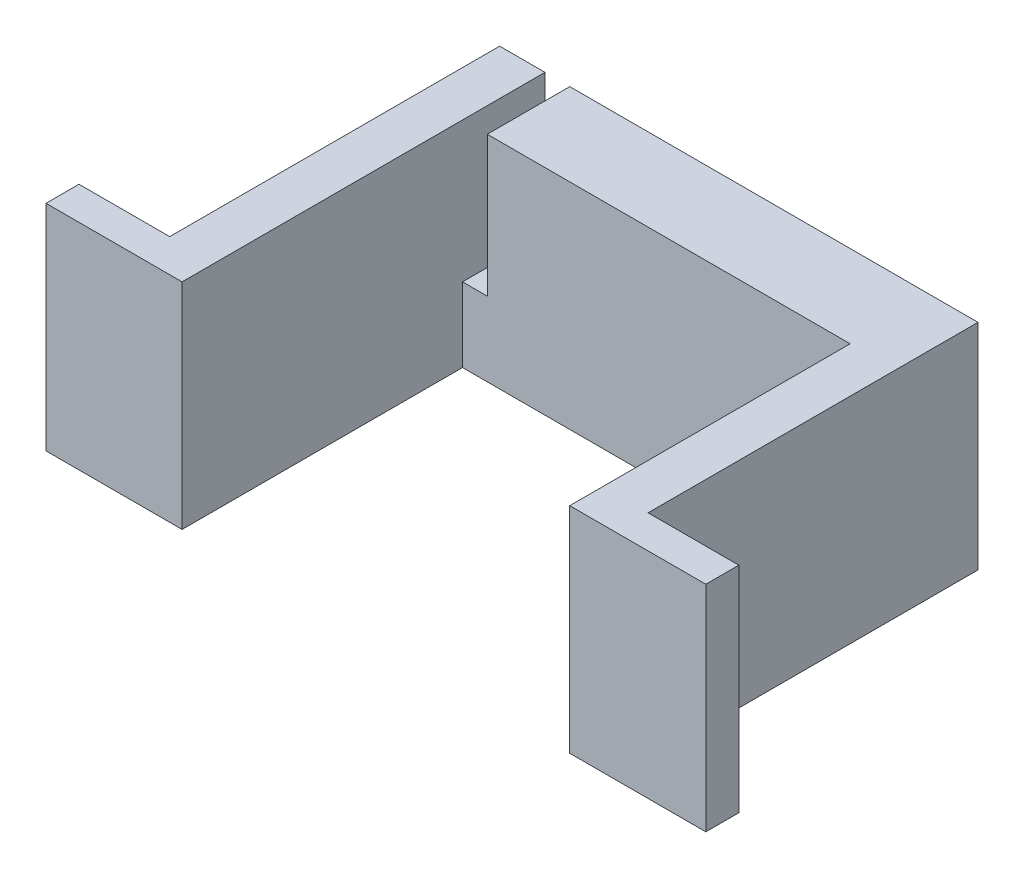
ISO-10303-21;
HEADER;
FILE_DESCRIPTION(('STEP AP214'),'2;1');
FILE_NAME('part.step','',(''),(''),'','','');
FILE_SCHEMA(('AUTOMOTIVE_DESIGN { 1 0 10303 214 1 1 1 1 }'));
ENDSEC;
DATA;
#1=APPLICATION_CONTEXT('core data for automotive mechanical design processes');
#2=APPLICATION_PROTOCOL_DEFINITION('international standard','automotive_design',2000,#1);
#3=PRODUCT_CONTEXT('',#1,'mechanical');
#4=PRODUCT('Part','Part','',(#3));
#5=PRODUCT_RELATED_PRODUCT_CATEGORY('part','',(#4));
#6=PRODUCT_DEFINITION_FORMATION('','',#4);
#7=PRODUCT_DEFINITION_CONTEXT('part definition',#1,'design');
#8=PRODUCT_DEFINITION('design','',#6,#7);
#9=PRODUCT_DEFINITION_SHAPE('','',#8);
#10=(LENGTH_UNIT() NAMED_UNIT(*) SI_UNIT(.MILLI.,.METRE.));
#11=(NAMED_UNIT(*) PLANE_ANGLE_UNIT() SI_UNIT($,.RADIAN.));
#12=(NAMED_UNIT(*) SI_UNIT($,.STERADIAN.) SOLID_ANGLE_UNIT());
#13=UNCERTAINTY_MEASURE_WITH_UNIT(LENGTH_MEASURE(1.E-05),#10,'distance_accuracy_value','');
#14=(GEOMETRIC_REPRESENTATION_CONTEXT(3) GLOBAL_UNCERTAINTY_ASSIGNED_CONTEXT((#13)) GLOBAL_UNIT_ASSIGNED_CONTEXT((#10,
#11,#12)) REPRESENTATION_CONTEXT('',''));
#15=CARTESIAN_POINT('',(0.,0.,0.));
#16=DIRECTION('',(0.,0.,1.));
#17=DIRECTION('',(1.,0.,0.));
#18=AXIS2_PLACEMENT_3D('',#15,#16,#17);
#19=CARTESIAN_POINT('',(0.,13.,0.));
#20=DIRECTION('',(0.,-1.,0.));
#21=DIRECTION('',(0.,0.,-1.));
#22=AXIS2_PLACEMENT_3D('',#19,#20,#21);
#23=PLANE('',#22);
#24=DIRECTION('',(0.,0.,1.));
#25=VECTOR('',#24,1.);
#26=CARTESIAN_POINT('',(2.75,13.,0.));
#27=LINE('',#26,#25);
#28=CARTESIAN_POINT('',(2.75,13.,-22.));
#29=VERTEX_POINT('',#28);
#30=CARTESIAN_POINT('',(2.75,13.,0.));
#31=VERTEX_POINT('',#30);
#32=EDGE_CURVE('E171',#29,#31,#27,.T.);
#33=ORIENTED_EDGE('',*,*,#32,.F.);
#34=DIRECTION('',(-1.,0.,0.));
#35=VECTOR('',#34,1.);
#36=CARTESIAN_POINT('',(0.,13.,-22.));
#37=LINE('',#36,#35);
#38=CARTESIAN_POINT('',(0.,13.,-22.));
#39=VERTEX_POINT('',#38);
#40=EDGE_CURVE('E255',#29,#39,#37,.T.);
#41=ORIENTED_EDGE('',*,*,#40,.T.);
#42=DIRECTION('',(0.,0.,1.));
#43=VECTOR('',#42,1.);
#44=CARTESIAN_POINT('',(0.,13.,0.));
#45=LINE('',#44,#43);
#46=CARTESIAN_POINT('',(0.,13.,-2.));
#47=VERTEX_POINT('',#46);
#48=EDGE_CURVE('E204',#39,#47,#45,.T.);
#49=ORIENTED_EDGE('',*,*,#48,.T.);
#50=DIRECTION('',(1.,0.,0.));
#51=VECTOR('',#50,1.);
#52=CARTESIAN_POINT('',(-5.5,13.,-2.));
#53=LINE('',#52,#51);
#54=CARTESIAN_POINT('',(-5.5,13.,-2.));
#55=VERTEX_POINT('',#54);
#56=EDGE_CURVE('E209',#55,#47,#53,.T.);
#57=ORIENTED_EDGE('',*,*,#56,.F.);
#58=DIRECTION('',(0.,0.,-1.));
#59=VECTOR('',#58,1.);
#60=CARTESIAN_POINT('',(-5.5,13.,0.));
#61=LINE('',#60,#59);
#62=CARTESIAN_POINT('',(-5.5,13.,0.));
#63=VERTEX_POINT('',#62);
#64=EDGE_CURVE('E188',#63,#55,#61,.T.);
#65=ORIENTED_EDGE('',*,*,#64,.F.);
#66=DIRECTION('',(1.,0.,0.));
#67=VECTOR('',#66,1.);
#68=CARTESIAN_POINT('',(0.,13.,0.));
#69=LINE('',#68,#67);
#70=EDGE_CURVE('E239',#63,#31,#69,.T.);
#71=ORIENTED_EDGE('',*,*,#70,.T.);
#72=EDGE_LOOP('',(#33,#41,#49,#57,#65,#71));
#73=FACE_BOUND('',#72,.T.);
#74=ADVANCED_FACE('F35',(#73),#23,.F.);
#75=CARTESIAN_POINT('',(0.,13.,0.));
#76=DIRECTION('',(0.,0.,-1.));
#77=DIRECTION('',(-1.,0.,0.));
#78=AXIS2_PLACEMENT_3D('',#75,#76,#77);
#79=PLANE('',#78);
#80=DIRECTION('',(1.,0.,0.));
#81=VECTOR('',#80,1.);
#82=CARTESIAN_POINT('',(0.,0.,0.));
#83=LINE('',#82,#81);
#84=CARTESIAN_POINT('',(-5.5,0.,0.));
#85=VERTEX_POINT('',#84);
#86=CARTESIAN_POINT('',(2.75,0.,0.));
#87=VERTEX_POINT('',#86);
#88=EDGE_CURVE('E288',#85,#87,#83,.T.);
#89=ORIENTED_EDGE('',*,*,#88,.T.);
#90=DIRECTION('',(0.,1.,0.));
#91=VECTOR('',#90,1.);
#92=CARTESIAN_POINT('',(2.75,-4.99999999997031E-05,0.));
#93=LINE('',#92,#91);
#94=EDGE_CURVE('E176',#87,#31,#93,.T.);
#95=ORIENTED_EDGE('',*,*,#94,.T.);
#96=ORIENTED_EDGE('',*,*,#70,.F.);
#97=DIRECTION('',(0.,1.,0.));
#98=VECTOR('',#97,1.);
#99=CARTESIAN_POINT('',(-5.5,0.,0.));
#100=LINE('',#99,#98);
#101=EDGE_CURVE('E185',#85,#63,#100,.T.);
#102=ORIENTED_EDGE('',*,*,#101,.F.);
#103=EDGE_LOOP('',(#89,#95,#96,#102));
#104=FACE_BOUND('',#103,.T.);
#105=ADVANCED_FACE('F320',(#104),#79,.F.);
#106=CARTESIAN_POINT('',(0.,13.,0.));
#107=DIRECTION('',(1.,0.,0.));
#108=DIRECTION('',(0.,0.,-1.));
#109=AXIS2_PLACEMENT_3D('',#106,#107,#108);
#110=PLANE('',#109);
#111=DIRECTION('',(0.,-1.,0.));
#112=VECTOR('',#111,1.);
#113=CARTESIAN_POINT('',(0.,0.,-2.));
#114=LINE('',#113,#112);
#115=CARTESIAN_POINT('',(0.,0.,-2.));
#116=VERTEX_POINT('',#115);
#117=EDGE_CURVE('E179',#47,#116,#114,.T.);
#118=ORIENTED_EDGE('',*,*,#117,.F.);
#119=ORIENTED_EDGE('',*,*,#48,.F.);
#120=DIRECTION('',(0.,-1.,0.));
#121=VECTOR('',#120,1.);
#122=CARTESIAN_POINT('',(0.,13.,-22.));
#123=LINE('',#122,#121);
#124=CARTESIAN_POINT('',(0.,0.,-22.));
#125=VERTEX_POINT('',#124);
#126=EDGE_CURVE('E293',#39,#125,#123,.T.);
#127=ORIENTED_EDGE('',*,*,#126,.T.);
#128=DIRECTION('',(0.,0.,1.));
#129=VECTOR('',#128,1.);
#130=CARTESIAN_POINT('',(0.,0.,0.));
#131=LINE('',#130,#129);
#132=EDGE_CURVE('E281',#125,#116,#131,.T.);
#133=ORIENTED_EDGE('',*,*,#132,.T.);
#134=EDGE_LOOP('',(#118,#119,#127,#133));
#135=FACE_BOUND('',#134,.T.);
#136=ADVANCED_FACE('F37',(#135),#110,.F.);
#137=CARTESIAN_POINT('',(29.,13.,0.));
#138=DIRECTION('',(-1.,0.,0.));
#139=DIRECTION('',(0.,0.,1.));
#140=AXIS2_PLACEMENT_3D('',#137,#138,#139);
#141=PLANE('',#140);
#142=DIRECTION('',(0.,1.,0.));
#143=VECTOR('',#142,1.);
#144=CARTESIAN_POINT('',(29.,13.,-2.));
#145=LINE('',#144,#143);
#146=CARTESIAN_POINT('',(29.,0.,-2.));
#147=VERTEX_POINT('',#146);
#148=CARTESIAN_POINT('',(29.,13.,-2.));
#149=VERTEX_POINT('',#148);
#150=EDGE_CURVE('E214',#147,#149,#145,.T.);
#151=ORIENTED_EDGE('',*,*,#150,.F.);
#152=DIRECTION('',(0.,0.,-1.));
#153=VECTOR('',#152,1.);
#154=CARTESIAN_POINT('',(29.,0.,0.));
#155=LINE('',#154,#153);
#156=CARTESIAN_POINT('',(29.,0.,-22.));
#157=VERTEX_POINT('',#156);
#158=EDGE_CURVE('E256',#147,#157,#155,.T.);
#159=ORIENTED_EDGE('',*,*,#158,.T.);
#160=DIRECTION('',(0.,-1.,0.));
#161=VECTOR('',#160,1.);
#162=CARTESIAN_POINT('',(29.,13.,-22.));
#163=LINE('',#162,#161);
#164=CARTESIAN_POINT('',(29.,13.,-22.));
#165=VERTEX_POINT('',#164);
#166=EDGE_CURVE('E218',#165,#157,#163,.T.);
#167=ORIENTED_EDGE('',*,*,#166,.F.);
#168=DIRECTION('',(0.,0.,-1.));
#169=VECTOR('',#168,1.);
#170=CARTESIAN_POINT('',(29.,13.,0.));
#171=LINE('',#170,#169);
#172=EDGE_CURVE('E242',#149,#165,#171,.T.);
#173=ORIENTED_EDGE('',*,*,#172,.F.);
#174=EDGE_LOOP('',(#151,#159,#167,#173));
#175=FACE_BOUND('',#174,.T.);
#176=ADVANCED_FACE('F348',(#175),#141,.F.);
#177=CARTESIAN_POINT('',(26.25,13.,0.));
#178=VERTEX_POINT('',#177);
#179=CARTESIAN_POINT('',(34.5,13.,0.));
#180=VERTEX_POINT('',#179);
#181=EDGE_CURVE('E234',#178,#180,#69,.T.);
#182=ORIENTED_EDGE('',*,*,#181,.F.);
#183=DIRECTION('',(0.,1.,0.));
#184=VECTOR('',#183,1.);
#185=CARTESIAN_POINT('',(26.25,-4.99999999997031E-05,0.));
#186=LINE('',#185,#184);
#187=CARTESIAN_POINT('',(26.25,0.,0.));
#188=VERTEX_POINT('',#187);
#189=EDGE_CURVE('E181',#188,#178,#186,.T.);
#190=ORIENTED_EDGE('',*,*,#189,.F.);
#191=CARTESIAN_POINT('',(34.5,0.,0.));
#192=VERTEX_POINT('',#191);
#193=EDGE_CURVE('E226',#188,#192,#83,.T.);
#194=ORIENTED_EDGE('',*,*,#193,.T.);
#195=DIRECTION('',(0.,-1.,0.));
#196=VECTOR('',#195,1.);
#197=CARTESIAN_POINT('',(34.5,13.,0.));
#198=LINE('',#197,#196);
#199=EDGE_CURVE('E198',#180,#192,#198,.T.);
#200=ORIENTED_EDGE('',*,*,#199,.F.);
#201=EDGE_LOOP('',(#182,#190,#194,#200));
#202=FACE_BOUND('',#201,.T.);
#203=ADVANCED_FACE('F232',(#202),#79,.F.);
#204=CARTESIAN_POINT('',(0.,13.,-22.));
#205=DIRECTION('',(0.,0.,1.));
#206=DIRECTION('',(1.,0.,0.));
#207=AXIS2_PLACEMENT_3D('',#204,#205,#206);
#208=PLANE('',#207);
#209=ORIENTED_EDGE('',*,*,#40,.F.);
#210=DIRECTION('',(0.,-1.,0.));
#211=VECTOR('',#210,1.);
#212=CARTESIAN_POINT('',(2.75,13.,-22.));
#213=LINE('',#212,#211);
#214=CARTESIAN_POINT('',(2.75,4.5,-22.));
#215=VERTEX_POINT('',#214);
#216=EDGE_CURVE('E168',#29,#215,#213,.T.);
#217=ORIENTED_EDGE('',*,*,#216,.T.);
#218=DIRECTION('',(1.,0.,0.));
#219=VECTOR('',#218,1.);
#220=CARTESIAN_POINT('',(0.,4.5,-22.));
#221=LINE('',#220,#219);
#222=CARTESIAN_POINT('',(4.25,4.5,-22.));
#223=VERTEX_POINT('',#222);
#224=EDGE_CURVE('E164',#215,#223,#221,.T.);
#225=ORIENTED_EDGE('',*,*,#224,.T.);
#226=DIRECTION('',(0.,1.,0.));
#227=VECTOR('',#226,1.);
#228=CARTESIAN_POINT('',(4.25,13.,-22.));
#229=LINE('',#228,#227);
#230=CARTESIAN_POINT('',(4.25,13.,-22.));
#231=VERTEX_POINT('',#230);
#232=EDGE_CURVE('E147',#223,#231,#229,.T.);
#233=ORIENTED_EDGE('',*,*,#232,.T.);
#234=EDGE_CURVE('E250',#165,#231,#37,.T.);
#235=ORIENTED_EDGE('',*,*,#234,.F.);
#236=ORIENTED_EDGE('',*,*,#166,.T.);
#237=DIRECTION('',(-1.,0.,0.));
#238=VECTOR('',#237,1.);
#239=CARTESIAN_POINT('',(0.,0.,-22.));
#240=LINE('',#239,#238);
#241=EDGE_CURVE('E244',#157,#125,#240,.T.);
#242=ORIENTED_EDGE('',*,*,#241,.T.);
#243=ORIENTED_EDGE('',*,*,#126,.F.);
#244=EDGE_LOOP('',(#209,#217,#225,#233,#235,#236,#242,#243));
#245=FACE_BOUND('',#244,.T.);
#246=ADVANCED_FACE('F300',(#245),#208,.F.);
#247=ORIENTED_EDGE('',*,*,#234,.T.);
#248=DIRECTION('',(0.,0.,1.));
#249=VECTOR('',#248,1.);
#250=CARTESIAN_POINT('',(4.25,13.,-22.000025));
#251=LINE('',#250,#249);
#252=CARTESIAN_POINT('',(4.25,13.,-17.));
#253=VERTEX_POINT('',#252);
#254=EDGE_CURVE('E149',#231,#253,#251,.T.);
#255=ORIENTED_EDGE('',*,*,#254,.T.);
#256=DIRECTION('',(-1.,0.,0.));
#257=VECTOR('',#256,1.);
#258=CARTESIAN_POINT('',(2.75,13.,-17.));
#259=LINE('',#258,#257);
#260=CARTESIAN_POINT('',(26.25,13.,-17.));
#261=VERTEX_POINT('',#260);
#262=EDGE_CURVE('E160',#261,#253,#259,.T.);
#263=ORIENTED_EDGE('',*,*,#262,.F.);
#264=DIRECTION('',(0.,0.,-1.));
#265=VECTOR('',#264,1.);
#266=CARTESIAN_POINT('',(26.25,13.,0.));
#267=LINE('',#266,#265);
#268=EDGE_CURVE('E173',#178,#261,#267,.T.);
#269=ORIENTED_EDGE('',*,*,#268,.F.);
#270=ORIENTED_EDGE('',*,*,#181,.T.);
#271=DIRECTION('',(0.,0.,1.));
#272=VECTOR('',#271,1.);
#273=CARTESIAN_POINT('',(34.5,13.,0.));
#274=LINE('',#273,#272);
#275=CARTESIAN_POINT('',(34.5,13.,-2.));
#276=VERTEX_POINT('',#275);
#277=EDGE_CURVE('E265',#276,#180,#274,.T.);
#278=ORIENTED_EDGE('',*,*,#277,.F.);
#279=DIRECTION('',(-1.,0.,0.));
#280=VECTOR('',#279,1.);
#281=CARTESIAN_POINT('',(34.5,13.,-2.));
#282=LINE('',#281,#280);
#283=EDGE_CURVE('E261',#276,#149,#282,.T.);
#284=ORIENTED_EDGE('',*,*,#283,.T.);
#285=ORIENTED_EDGE('',*,*,#172,.T.);
#286=EDGE_LOOP('',(#247,#255,#263,#269,#270,#278,#284,#285));
#287=FACE_BOUND('',#286,.T.);
#288=ADVANCED_FACE('F276',(#287),#23,.F.);
#289=CARTESIAN_POINT('',(0.,0.,0.));
#290=DIRECTION('',(0.,-1.,0.));
#291=DIRECTION('',(0.,0.,-1.));
#292=AXIS2_PLACEMENT_3D('',#289,#290,#291);
#293=PLANE('',#292);
#294=DIRECTION('',(0.,0.,-1.));
#295=VECTOR('',#294,1.);
#296=CARTESIAN_POINT('',(2.75,0.,0.));
#297=LINE('',#296,#295);
#298=CARTESIAN_POINT('',(2.75,0.,-17.));
#299=VERTEX_POINT('',#298);
#300=EDGE_CURVE('E11',#87,#299,#297,.T.);
#301=ORIENTED_EDGE('',*,*,#300,.F.);
#302=ORIENTED_EDGE('',*,*,#88,.F.);
#303=DIRECTION('',(0.,0.,1.));
#304=VECTOR('',#303,1.);
#305=CARTESIAN_POINT('',(-5.5,0.,0.));
#306=LINE('',#305,#304);
#307=CARTESIAN_POINT('',(-5.5,0.,-2.));
#308=VERTEX_POINT('',#307);
#309=EDGE_CURVE('E192',#308,#85,#306,.T.);
#310=ORIENTED_EDGE('',*,*,#309,.F.);
#311=DIRECTION('',(1.,0.,0.));
#312=VECTOR('',#311,1.);
#313=CARTESIAN_POINT('',(-5.5,0.,-2.));
#314=LINE('',#313,#312);
#315=EDGE_CURVE('E195',#308,#116,#314,.T.);
#316=ORIENTED_EDGE('',*,*,#315,.T.);
#317=ORIENTED_EDGE('',*,*,#132,.F.);
#318=ORIENTED_EDGE('',*,*,#241,.F.);
#319=ORIENTED_EDGE('',*,*,#158,.F.);
#320=DIRECTION('',(-1.,0.,0.));
#321=VECTOR('',#320,1.);
#322=CARTESIAN_POINT('',(34.5,0.,-2.));
#323=LINE('',#322,#321);
#324=CARTESIAN_POINT('',(34.5,0.,-2.));
#325=VERTEX_POINT('',#324);
#326=EDGE_CURVE('E279',#325,#147,#323,.T.);
#327=ORIENTED_EDGE('',*,*,#326,.F.);
#328=DIRECTION('',(0.,0.,-1.));
#329=VECTOR('',#328,1.);
#330=CARTESIAN_POINT('',(34.5,0.,0.));
#331=LINE('',#330,#329);
#332=EDGE_CURVE('E268',#192,#325,#331,.T.);
#333=ORIENTED_EDGE('',*,*,#332,.F.);
#334=ORIENTED_EDGE('',*,*,#193,.F.);
#335=DIRECTION('',(0.,0.,1.));
#336=VECTOR('',#335,1.);
#337=CARTESIAN_POINT('',(26.25,0.,0.));
#338=LINE('',#337,#336);
#339=CARTESIAN_POINT('',(26.25,0.,-17.));
#340=VERTEX_POINT('',#339);
#341=EDGE_CURVE('E217',#340,#188,#338,.T.);
#342=ORIENTED_EDGE('',*,*,#341,.F.);
#343=DIRECTION('',(1.,0.,0.));
#344=VECTOR('',#343,1.);
#345=CARTESIAN_POINT('',(0.,0.,-17.));
#346=LINE('',#345,#344);
#347=EDGE_CURVE('E43',#299,#340,#346,.T.);
#348=ORIENTED_EDGE('',*,*,#347,.F.);
#349=EDGE_LOOP('',(#301,#302,#310,#316,#317,#318,#319,#327,#333,#334,#342,#348));
#350=FACE_BOUND('',#349,.T.);
#351=ADVANCED_FACE('F224',(#350),#293,.T.);
#352=CARTESIAN_POINT('',(34.5,13.,-2.));
#353=DIRECTION('',(0.,0.,1.));
#354=DIRECTION('',(0.,-1.,0.));
#355=AXIS2_PLACEMENT_3D('',#352,#353,#354);
#356=PLANE('',#355);
#357=ORIENTED_EDGE('',*,*,#150,.T.);
#358=ORIENTED_EDGE('',*,*,#283,.F.);
#359=DIRECTION('',(0.,1.,0.));
#360=VECTOR('',#359,1.);
#361=CARTESIAN_POINT('',(34.5,13.,-2.));
#362=LINE('',#361,#360);
#363=EDGE_CURVE('E267',#325,#276,#362,.T.);
#364=ORIENTED_EDGE('',*,*,#363,.F.);
#365=ORIENTED_EDGE('',*,*,#326,.T.);
#366=EDGE_LOOP('',(#357,#358,#364,#365));
#367=FACE_BOUND('',#366,.T.);
#368=ADVANCED_FACE('F343',(#367),#356,.F.);
#369=CARTESIAN_POINT('',(34.5,0.,0.));
#370=DIRECTION('',(1.,0.,0.));
#371=DIRECTION('',(0.,0.,-1.));
#372=AXIS2_PLACEMENT_3D('',#369,#370,#371);
#373=PLANE('',#372);
#374=ORIENTED_EDGE('',*,*,#199,.T.);
#375=ORIENTED_EDGE('',*,*,#332,.T.);
#376=ORIENTED_EDGE('',*,*,#363,.T.);
#377=ORIENTED_EDGE('',*,*,#277,.T.);
#378=EDGE_LOOP('',(#374,#375,#376,#377));
#379=FACE_BOUND('',#378,.T.);
#380=ADVANCED_FACE('F271',(#379),#373,.T.);
#381=CARTESIAN_POINT('',(-5.5,0.,-2.));
#382=DIRECTION('',(0.,0.,1.));
#383=DIRECTION('',(1.,0.,0.));
#384=AXIS2_PLACEMENT_3D('',#381,#382,#383);
#385=PLANE('',#384);
#386=ORIENTED_EDGE('',*,*,#117,.T.);
#387=ORIENTED_EDGE('',*,*,#315,.F.);
#388=DIRECTION('',(0.,-1.,0.));
#389=VECTOR('',#388,1.);
#390=CARTESIAN_POINT('',(-5.5,0.,-2.));
#391=LINE('',#390,#389);
#392=EDGE_CURVE('E190',#55,#308,#391,.T.);
#393=ORIENTED_EDGE('',*,*,#392,.F.);
#394=ORIENTED_EDGE('',*,*,#56,.T.);
#395=EDGE_LOOP('',(#386,#387,#393,#394));
#396=FACE_BOUND('',#395,.T.);
#397=ADVANCED_FACE('F310',(#396),#385,.F.);
#398=CARTESIAN_POINT('',(-5.5,0.,0.));
#399=DIRECTION('',(-1.,0.,0.));
#400=DIRECTION('',(0.,0.,1.));
#401=AXIS2_PLACEMENT_3D('',#398,#399,#400);
#402=PLANE('',#401);
#403=ORIENTED_EDGE('',*,*,#101,.T.);
#404=ORIENTED_EDGE('',*,*,#64,.T.);
#405=ORIENTED_EDGE('',*,*,#392,.T.);
#406=ORIENTED_EDGE('',*,*,#309,.T.);
#407=EDGE_LOOP('',(#403,#404,#405,#406));
#408=FACE_BOUND('',#407,.T.);
#409=ADVANCED_FACE('F322',(#408),#402,.T.);
#410=CARTESIAN_POINT('',(2.75,-4.99999999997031E-05,0.));
#411=DIRECTION('',(-1.,0.,0.));
#412=DIRECTION('',(0.,0.,1.));
#413=AXIS2_PLACEMENT_3D('',#410,#411,#412);
#414=PLANE('',#413);
#415=ORIENTED_EDGE('',*,*,#300,.T.);
#416=DIRECTION('',(0.,1.,0.));
#417=VECTOR('',#416,1.);
#418=CARTESIAN_POINT('',(2.75,-4.99999999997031E-05,-17.));
#419=LINE('',#418,#417);
#420=CARTESIAN_POINT('',(2.75,4.5,-17.));
#421=VERTEX_POINT('',#420);
#422=EDGE_CURVE('E177',#299,#421,#419,.T.);
#423=ORIENTED_EDGE('',*,*,#422,.T.);
#424=DIRECTION('',(0.,0.,1.));
#425=VECTOR('',#424,1.);
#426=CARTESIAN_POINT('',(2.75,4.5,-22.000025));
#427=LINE('',#426,#425);
#428=EDGE_CURVE('E50',#215,#421,#427,.T.);
#429=ORIENTED_EDGE('',*,*,#428,.F.);
#430=ORIENTED_EDGE('',*,*,#216,.F.);
#431=ORIENTED_EDGE('',*,*,#32,.T.);
#432=ORIENTED_EDGE('',*,*,#94,.F.);
#433=EDGE_LOOP('',(#415,#423,#429,#430,#431,#432));
#434=FACE_BOUND('',#433,.T.);
#435=ADVANCED_FACE('F317',(#434),#414,.F.);
#436=CARTESIAN_POINT('',(2.75,-4.99999999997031E-05,-17.));
#437=DIRECTION('',(0.,0.,-1.));
#438=DIRECTION('',(-1.,0.,0.));
#439=AXIS2_PLACEMENT_3D('',#436,#437,#438);
#440=PLANE('',#439);
#441=ORIENTED_EDGE('',*,*,#262,.T.);
#442=DIRECTION('',(0.,1.,0.));
#443=VECTOR('',#442,1.);
#444=CARTESIAN_POINT('',(4.25,13.,-17.));
#445=LINE('',#444,#443);
#446=CARTESIAN_POINT('',(4.25,4.5,-17.));
#447=VERTEX_POINT('',#446);
#448=EDGE_CURVE('E144',#447,#253,#445,.T.);
#449=ORIENTED_EDGE('',*,*,#448,.F.);
#450=DIRECTION('',(1.,0.,0.));
#451=VECTOR('',#450,1.);
#452=CARTESIAN_POINT('',(2.75,4.5,-17.));
#453=LINE('',#452,#451);
#454=EDGE_CURVE('E151',#421,#447,#453,.T.);
#455=ORIENTED_EDGE('',*,*,#454,.F.);
#456=ORIENTED_EDGE('',*,*,#422,.F.);
#457=ORIENTED_EDGE('',*,*,#347,.T.);
#458=DIRECTION('',(0.,1.,0.));
#459=VECTOR('',#458,1.);
#460=CARTESIAN_POINT('',(26.25,-4.99999999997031E-05,-17.));
#461=LINE('',#460,#459);
#462=EDGE_CURVE('E58',#340,#261,#461,.T.);
#463=ORIENTED_EDGE('',*,*,#462,.T.);
#464=EDGE_LOOP('',(#441,#449,#455,#456,#457,#463));
#465=FACE_BOUND('',#464,.T.);
#466=ADVANCED_FACE('F158',(#465),#440,.F.);
#467=CARTESIAN_POINT('',(26.25,-4.99999999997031E-05,0.));
#468=DIRECTION('',(1.,0.,0.));
#469=DIRECTION('',(0.,0.,-1.));
#470=AXIS2_PLACEMENT_3D('',#467,#468,#469);
#471=PLANE('',#470);
#472=ORIENTED_EDGE('',*,*,#341,.T.);
#473=ORIENTED_EDGE('',*,*,#189,.T.);
#474=ORIENTED_EDGE('',*,*,#268,.T.);
#475=ORIENTED_EDGE('',*,*,#462,.F.);
#476=EDGE_LOOP('',(#472,#473,#474,#475));
#477=FACE_BOUND('',#476,.T.);
#478=ADVANCED_FACE('F228',(#477),#471,.F.);
#479=CARTESIAN_POINT('',(4.25,13.,-22.000025));
#480=DIRECTION('',(1.,0.,0.));
#481=DIRECTION('',(0.,1.,0.));
#482=AXIS2_PLACEMENT_3D('',#479,#480,#481);
#483=PLANE('',#482);
#484=DIRECTION('',(0.,0.,1.));
#485=VECTOR('',#484,1.);
#486=CARTESIAN_POINT('',(4.25,4.5,-22.000025));
#487=LINE('',#486,#485);
#488=EDGE_CURVE('E141',#223,#447,#487,.T.);
#489=ORIENTED_EDGE('',*,*,#488,.T.);
#490=ORIENTED_EDGE('',*,*,#448,.T.);
#491=ORIENTED_EDGE('',*,*,#254,.F.);
#492=ORIENTED_EDGE('',*,*,#232,.F.);
#493=EDGE_LOOP('',(#489,#490,#491,#492));
#494=FACE_BOUND('',#493,.T.);
#495=ADVANCED_FACE('F142',(#494),#483,.F.);
#496=CARTESIAN_POINT('',(2.75,4.5,-22.000025));
#497=DIRECTION('',(0.,-1.,0.));
#498=DIRECTION('',(0.,0.,-1.));
#499=AXIS2_PLACEMENT_3D('',#496,#497,#498);
#500=PLANE('',#499);
#501=ORIENTED_EDGE('',*,*,#428,.T.);
#502=ORIENTED_EDGE('',*,*,#454,.T.);
#503=ORIENTED_EDGE('',*,*,#488,.F.);
#504=ORIENTED_EDGE('',*,*,#224,.F.);
#505=EDGE_LOOP('',(#501,#502,#503,#504));
#506=FACE_BOUND('',#505,.T.);
#507=ADVANCED_FACE('F152',(#506),#500,.F.);
#508=CLOSED_SHELL('',(#74,#105,#136,#176,#203,#246,#288,#351,#368,#380,#397,#409,#435,#466,#478,
#495,#507));
#509=MANIFOLD_SOLID_BREP('B2',#508);
#510=ADVANCED_BREP_SHAPE_REPRESENTATION('',(#18,#509),#14);
#511=SHAPE_DEFINITION_REPRESENTATION(#9,#510);
ENDSEC;
END-ISO-10303-21;
